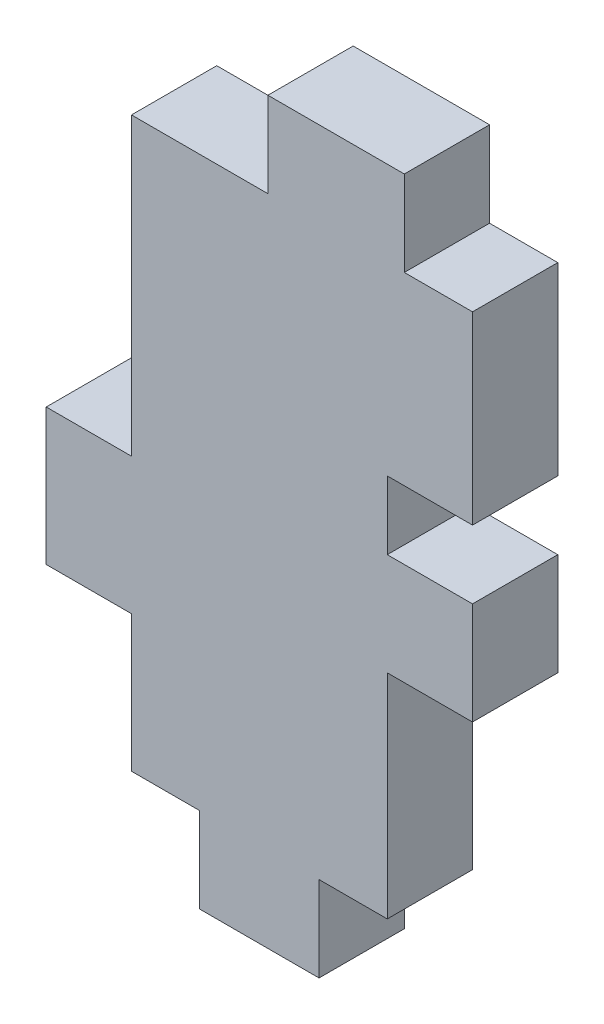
ISO-10303-21;
HEADER;
FILE_DESCRIPTION(('STEP AP214'),'2;1');
FILE_NAME('part.step','',(''),(''),'','','');
FILE_SCHEMA(('AUTOMOTIVE_DESIGN { 1 0 10303 214 1 1 1 1 }'));
ENDSEC;
DATA;
#1=APPLICATION_CONTEXT('core data for automotive mechanical design processes');
#2=APPLICATION_PROTOCOL_DEFINITION('international standard','automotive_design',2000,#1);
#3=PRODUCT_CONTEXT('',#1,'mechanical');
#4=PRODUCT('Part','Part','',(#3));
#5=PRODUCT_RELATED_PRODUCT_CATEGORY('part','',(#4));
#6=PRODUCT_DEFINITION_FORMATION('','',#4);
#7=PRODUCT_DEFINITION_CONTEXT('part definition',#1,'design');
#8=PRODUCT_DEFINITION('design','',#6,#7);
#9=PRODUCT_DEFINITION_SHAPE('','',#8);
#10=(LENGTH_UNIT() NAMED_UNIT(*) SI_UNIT(.MILLI.,.METRE.));
#11=(NAMED_UNIT(*) PLANE_ANGLE_UNIT() SI_UNIT($,.RADIAN.));
#12=(NAMED_UNIT(*) SI_UNIT($,.STERADIAN.) SOLID_ANGLE_UNIT());
#13=UNCERTAINTY_MEASURE_WITH_UNIT(LENGTH_MEASURE(1.E-05),#10,'distance_accuracy_value','');
#14=(GEOMETRIC_REPRESENTATION_CONTEXT(3) GLOBAL_UNCERTAINTY_ASSIGNED_CONTEXT((#13)) GLOBAL_UNIT_ASSIGNED_CONTEXT((#10,
#11,#12)) REPRESENTATION_CONTEXT('',''));
#15=CARTESIAN_POINT('',(0.,0.,0.));
#16=DIRECTION('',(0.,0.,1.));
#17=DIRECTION('',(1.,0.,0.));
#18=AXIS2_PLACEMENT_3D('',#15,#16,#17);
#19=CARTESIAN_POINT('',(0.,42.333333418,6.35));
#20=DIRECTION('',(0.,-1.,0.));
#21=DIRECTION('',(0.,0.,-1.));
#22=AXIS2_PLACEMENT_3D('',#19,#20,#21);
#23=PLANE('',#22);
#24=DIRECTION('',(0.,0.,1.));
#25=VECTOR('',#24,1.);
#26=CARTESIAN_POINT('',(-8.89,42.333333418,0.));
#27=LINE('',#26,#25);
#28=CARTESIAN_POINT('',(-8.89,42.333333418,0.));
#29=VERTEX_POINT('',#28);
#30=CARTESIAN_POINT('',(-8.89,42.333333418,6.35));
#31=VERTEX_POINT('',#30);
#32=EDGE_CURVE('E222',#29,#31,#27,.T.);
#33=ORIENTED_EDGE('',*,*,#32,.F.);
#34=DIRECTION('',(-1.,0.,0.));
#35=VECTOR('',#34,1.);
#36=CARTESIAN_POINT('',(0.,42.333333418,0.));
#37=LINE('',#36,#35);
#38=CARTESIAN_POINT('',(-19.05,42.333333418,0.));
#39=VERTEX_POINT('',#38);
#40=EDGE_CURVE('E387',#29,#39,#37,.T.);
#41=ORIENTED_EDGE('',*,*,#40,.T.);
#42=DIRECTION('',(0.,0.,-1.));
#43=VECTOR('',#42,1.);
#44=CARTESIAN_POINT('',(-19.05,42.333333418,6.35));
#45=LINE('',#44,#43);
#46=CARTESIAN_POINT('',(-19.05,42.333333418,6.35));
#47=VERTEX_POINT('',#46);
#48=EDGE_CURVE('E358',#47,#39,#45,.T.);
#49=ORIENTED_EDGE('',*,*,#48,.F.);
#50=DIRECTION('',(-1.,0.,0.));
#51=VECTOR('',#50,1.);
#52=CARTESIAN_POINT('',(0.,42.333333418,6.35));
#53=LINE('',#52,#51);
#54=EDGE_CURVE('E64',#31,#47,#53,.T.);
#55=ORIENTED_EDGE('',*,*,#54,.F.);
#56=EDGE_LOOP('',(#33,#41,#49,#55));
#57=FACE_BOUND('',#56,.T.);
#58=ADVANCED_FACE('F48',(#57),#23,.F.);
#59=DIRECTION('',(0.,0.,-1.));
#60=VECTOR('',#59,1.);
#61=CARTESIAN_POINT('',(1.27,42.333333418,0.));
#62=LINE('',#61,#60);
#63=CARTESIAN_POINT('',(1.27,42.333333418,6.35));
#64=VERTEX_POINT('',#63);
#65=CARTESIAN_POINT('',(1.27,42.333333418,0.));
#66=VERTEX_POINT('',#65);
#67=EDGE_CURVE('E72',#64,#66,#62,.T.);
#68=ORIENTED_EDGE('',*,*,#67,.F.);
#69=CARTESIAN_POINT('',(6.35,42.333333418,6.35));
#70=VERTEX_POINT('',#69);
#71=EDGE_CURVE('E355',#70,#64,#53,.T.);
#72=ORIENTED_EDGE('',*,*,#71,.F.);
#73=DIRECTION('',(0.,0.,1.));
#74=VECTOR('',#73,1.);
#75=CARTESIAN_POINT('',(6.35,42.333333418,6.35));
#76=LINE('',#75,#74);
#77=CARTESIAN_POINT('',(6.35,42.333333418,0.));
#78=VERTEX_POINT('',#77);
#79=EDGE_CURVE('E279',#78,#70,#76,.T.);
#80=ORIENTED_EDGE('',*,*,#79,.F.);
#81=EDGE_CURVE('E384',#78,#66,#37,.T.);
#82=ORIENTED_EDGE('',*,*,#81,.T.);
#83=EDGE_LOOP('',(#68,#72,#80,#82));
#84=FACE_BOUND('',#83,.T.);
#85=ADVANCED_FACE('F474',(#84),#23,.F.);
#86=CARTESIAN_POINT('',(-19.05,0.,6.35));
#87=DIRECTION('',(-1.,0.,0.));
#88=DIRECTION('',(0.,0.,1.));
#89=AXIS2_PLACEMENT_3D('',#86,#87,#88);
#90=PLANE('',#89);
#91=DIRECTION('',(0.,0.,-1.));
#92=VECTOR('',#91,1.);
#93=CARTESIAN_POINT('',(-19.05,20.32,0.));
#94=LINE('',#93,#92);
#95=CARTESIAN_POINT('',(-19.05,20.32,6.35));
#96=VERTEX_POINT('',#95);
#97=CARTESIAN_POINT('',(-19.05,20.32,0.));
#98=VERTEX_POINT('',#97);
#99=EDGE_CURVE('E229',#96,#98,#94,.T.);
#100=ORIENTED_EDGE('',*,*,#99,.F.);
#101=DIRECTION('',(0.,1.,0.));
#102=VECTOR('',#101,1.);
#103=CARTESIAN_POINT('',(-19.05,0.,6.35));
#104=LINE('',#103,#102);
#105=EDGE_CURVE('E336',#96,#47,#104,.T.);
#106=ORIENTED_EDGE('',*,*,#105,.T.);
#107=ORIENTED_EDGE('',*,*,#48,.T.);
#108=DIRECTION('',(0.,1.,0.));
#109=VECTOR('',#108,1.);
#110=CARTESIAN_POINT('',(-19.05,0.,0.));
#111=LINE('',#110,#109);
#112=EDGE_CURVE('E331',#98,#39,#111,.T.);
#113=ORIENTED_EDGE('',*,*,#112,.F.);
#114=EDGE_LOOP('',(#100,#106,#107,#113));
#115=FACE_BOUND('',#114,.T.);
#116=ADVANCED_FACE('F445',(#115),#90,.T.);
#117=CARTESIAN_POINT('',(0.,0.,6.35));
#118=DIRECTION('',(-1.,0.,0.));
#119=DIRECTION('',(0.,0.,1.));
#120=AXIS2_PLACEMENT_3D('',#117,#118,#119);
#121=PLANE('',#120);
#122=DIRECTION('',(0.,0.,-1.));
#123=VECTOR('',#122,1.);
#124=CARTESIAN_POINT('',(0.,28.575,6.35));
#125=LINE('',#124,#123);
#126=CARTESIAN_POINT('',(0.,28.575,6.35));
#127=VERTEX_POINT('',#126);
#128=CARTESIAN_POINT('',(0.,28.575,0.));
#129=VERTEX_POINT('',#128);
#130=EDGE_CURVE('E267',#127,#129,#125,.T.);
#131=ORIENTED_EDGE('',*,*,#130,.F.);
#132=DIRECTION('',(0.,1.,0.));
#133=VECTOR('',#132,1.);
#134=CARTESIAN_POINT('',(0.,0.,6.35));
#135=LINE('',#134,#133);
#136=CARTESIAN_POINT('',(0.,23.495,6.35));
#137=VERTEX_POINT('',#136);
#138=EDGE_CURVE('E344',#137,#127,#135,.T.);
#139=ORIENTED_EDGE('',*,*,#138,.F.);
#140=DIRECTION('',(0.,0.,-1.));
#141=VECTOR('',#140,1.);
#142=CARTESIAN_POINT('',(0.,23.495,6.35));
#143=LINE('',#142,#141);
#144=CARTESIAN_POINT('',(0.,23.495,0.));
#145=VERTEX_POINT('',#144);
#146=EDGE_CURVE('E391',#137,#145,#143,.T.);
#147=ORIENTED_EDGE('',*,*,#146,.T.);
#148=DIRECTION('',(0.,1.,0.));
#149=VECTOR('',#148,1.);
#150=CARTESIAN_POINT('',(0.,0.,0.));
#151=LINE('',#150,#149);
#152=EDGE_CURVE('E372',#145,#129,#151,.T.);
#153=ORIENTED_EDGE('',*,*,#152,.T.);
#154=EDGE_LOOP('',(#131,#139,#147,#153));
#155=FACE_BOUND('',#154,.T.);
#156=ADVANCED_FACE('F483',(#155),#121,.F.);
#157=CARTESIAN_POINT('',(0.,0.,6.35));
#158=DIRECTION('',(0.,-1.,0.));
#159=DIRECTION('',(0.,0.,-1.));
#160=AXIS2_PLACEMENT_3D('',#157,#158,#159);
#161=PLANE('',#160);
#162=DIRECTION('',(0.,0.,1.));
#163=VECTOR('',#162,1.);
#164=CARTESIAN_POINT('',(-5.08,0.,0.));
#165=LINE('',#164,#163);
#166=CARTESIAN_POINT('',(-5.08,0.,0.));
#167=VERTEX_POINT('',#166);
#168=CARTESIAN_POINT('',(-5.08,0.,6.35));
#169=VERTEX_POINT('',#168);
#170=EDGE_CURVE('E294',#167,#169,#165,.T.);
#171=ORIENTED_EDGE('',*,*,#170,.F.);
#172=DIRECTION('',(-1.,0.,0.));
#173=VECTOR('',#172,1.);
#174=CARTESIAN_POINT('',(0.,0.,0.));
#175=LINE('',#174,#173);
#176=CARTESIAN_POINT('',(0.,0.,0.));
#177=VERTEX_POINT('',#176);
#178=EDGE_CURVE('E364',#177,#167,#175,.T.);
#179=ORIENTED_EDGE('',*,*,#178,.F.);
#180=DIRECTION('',(0.,0.,-1.));
#181=VECTOR('',#180,1.);
#182=CARTESIAN_POINT('',(0.,0.,6.35));
#183=LINE('',#182,#181);
#184=CARTESIAN_POINT('',(0.,0.,6.35));
#185=VERTEX_POINT('',#184);
#186=EDGE_CURVE('E57',#185,#177,#183,.T.);
#187=ORIENTED_EDGE('',*,*,#186,.F.);
#188=DIRECTION('',(-1.,0.,0.));
#189=VECTOR('',#188,1.);
#190=CARTESIAN_POINT('',(0.,0.,6.35));
#191=LINE('',#190,#189);
#192=EDGE_CURVE('E337',#185,#169,#191,.T.);
#193=ORIENTED_EDGE('',*,*,#192,.T.);
#194=EDGE_LOOP('',(#171,#179,#187,#193));
#195=FACE_BOUND('',#194,.T.);
#196=ADVANCED_FACE('F416',(#195),#161,.T.);
#197=DIRECTION('',(0.,0.,1.));
#198=VECTOR('',#197,1.);
#199=CARTESIAN_POINT('',(-19.05,10.16,0.));
#200=LINE('',#199,#198);
#201=CARTESIAN_POINT('',(-19.05,10.16,0.));
#202=VERTEX_POINT('',#201);
#203=CARTESIAN_POINT('',(-19.05,10.16,6.35));
#204=VERTEX_POINT('',#203);
#205=EDGE_CURVE('E224',#202,#204,#200,.T.);
#206=ORIENTED_EDGE('',*,*,#205,.F.);
#207=CARTESIAN_POINT('',(-19.05,0.,0.));
#208=VERTEX_POINT('',#207);
#209=EDGE_CURVE('E359',#208,#202,#111,.T.);
#210=ORIENTED_EDGE('',*,*,#209,.F.);
#211=DIRECTION('',(0.,0.,-1.));
#212=VECTOR('',#211,1.);
#213=CARTESIAN_POINT('',(-19.05,0.,6.35));
#214=LINE('',#213,#212);
#215=CARTESIAN_POINT('',(-19.05,0.,6.35));
#216=VERTEX_POINT('',#215);
#217=EDGE_CURVE('E11',#216,#208,#214,.T.);
#218=ORIENTED_EDGE('',*,*,#217,.F.);
#219=EDGE_CURVE('E332',#216,#204,#104,.T.);
#220=ORIENTED_EDGE('',*,*,#219,.T.);
#221=EDGE_LOOP('',(#206,#210,#218,#220));
#222=FACE_BOUND('',#221,.T.);
#223=ADVANCED_FACE('F50',(#222),#90,.T.);
#224=DIRECTION('',(0.,0.,-1.));
#225=VECTOR('',#224,1.);
#226=CARTESIAN_POINT('',(-13.97,0.,0.));
#227=LINE('',#226,#225);
#228=CARTESIAN_POINT('',(-13.97,0.,6.35));
#229=VERTEX_POINT('',#228);
#230=CARTESIAN_POINT('',(-13.97,0.,0.));
#231=VERTEX_POINT('',#230);
#232=EDGE_CURVE('E300',#229,#231,#227,.T.);
#233=ORIENTED_EDGE('',*,*,#232,.F.);
#234=EDGE_CURVE('E335',#229,#216,#191,.T.);
#235=ORIENTED_EDGE('',*,*,#234,.T.);
#236=ORIENTED_EDGE('',*,*,#217,.T.);
#237=EDGE_CURVE('E363',#231,#208,#175,.T.);
#238=ORIENTED_EDGE('',*,*,#237,.F.);
#239=EDGE_LOOP('',(#233,#235,#236,#238));
#240=FACE_BOUND('',#239,.T.);
#241=ADVANCED_FACE('F431',(#240),#161,.T.);
#242=CARTESIAN_POINT('',(0.,15.875,0.));
#243=VERTEX_POINT('',#242);
#244=EDGE_CURVE('E368',#177,#243,#151,.T.);
#245=ORIENTED_EDGE('',*,*,#244,.T.);
#246=DIRECTION('',(0.,0.,-1.));
#247=VECTOR('',#246,1.);
#248=CARTESIAN_POINT('',(0.,15.875,6.35));
#249=LINE('',#248,#247);
#250=CARTESIAN_POINT('',(0.,15.875,6.35));
#251=VERTEX_POINT('',#250);
#252=EDGE_CURVE('E400',#251,#243,#249,.T.);
#253=ORIENTED_EDGE('',*,*,#252,.F.);
#254=EDGE_CURVE('E340',#185,#251,#135,.T.);
#255=ORIENTED_EDGE('',*,*,#254,.F.);
#256=ORIENTED_EDGE('',*,*,#186,.T.);
#257=EDGE_LOOP('',(#245,#253,#255,#256));
#258=FACE_BOUND('',#257,.T.);
#259=ADVANCED_FACE('F407',(#258),#121,.F.);
#260=CARTESIAN_POINT('',(0.,15.875,6.35));
#261=DIRECTION('',(0.,1.,0.));
#262=DIRECTION('',(0.,0.,1.));
#263=AXIS2_PLACEMENT_3D('',#260,#261,#262);
#264=PLANE('',#263);
#265=DIRECTION('',(1.,0.,0.));
#266=VECTOR('',#265,1.);
#267=CARTESIAN_POINT('',(0.,15.875,0.));
#268=LINE('',#267,#266);
#269=CARTESIAN_POINT('',(6.35,15.875,0.));
#270=VERTEX_POINT('',#269);
#271=EDGE_CURVE('E371',#243,#270,#268,.T.);
#272=ORIENTED_EDGE('',*,*,#271,.T.);
#273=DIRECTION('',(0.,0.,-1.));
#274=VECTOR('',#273,1.);
#275=CARTESIAN_POINT('',(6.35,15.875,6.35));
#276=LINE('',#275,#274);
#277=CARTESIAN_POINT('',(6.35,15.875,6.35));
#278=VERTEX_POINT('',#277);
#279=EDGE_CURVE('E397',#278,#270,#276,.T.);
#280=ORIENTED_EDGE('',*,*,#279,.F.);
#281=DIRECTION('',(1.,0.,0.));
#282=VECTOR('',#281,1.);
#283=CARTESIAN_POINT('',(0.,15.875,6.35));
#284=LINE('',#283,#282);
#285=EDGE_CURVE('E343',#251,#278,#284,.T.);
#286=ORIENTED_EDGE('',*,*,#285,.F.);
#287=ORIENTED_EDGE('',*,*,#252,.T.);
#288=EDGE_LOOP('',(#272,#280,#286,#287));
#289=FACE_BOUND('',#288,.T.);
#290=ADVANCED_FACE('F494',(#289),#264,.F.);
#291=CARTESIAN_POINT('',(6.35,0.,6.35));
#292=DIRECTION('',(1.,0.,0.));
#293=DIRECTION('',(0.,1.,0.));
#294=AXIS2_PLACEMENT_3D('',#291,#292,#293);
#295=PLANE('',#294);
#296=DIRECTION('',(0.,-1.,0.));
#297=VECTOR('',#296,1.);
#298=CARTESIAN_POINT('',(6.35,0.,0.));
#299=LINE('',#298,#297);
#300=CARTESIAN_POINT('',(6.35,23.495,0.));
#301=VERTEX_POINT('',#300);
#302=EDGE_CURVE('E376',#301,#270,#299,.T.);
#303=ORIENTED_EDGE('',*,*,#302,.F.);
#304=DIRECTION('',(0.,0.,-1.));
#305=VECTOR('',#304,1.);
#306=CARTESIAN_POINT('',(6.35,23.495,6.35));
#307=LINE('',#306,#305);
#308=CARTESIAN_POINT('',(6.35,23.495,6.35));
#309=VERTEX_POINT('',#308);
#310=EDGE_CURVE('E394',#309,#301,#307,.T.);
#311=ORIENTED_EDGE('',*,*,#310,.F.);
#312=DIRECTION('',(0.,-1.,0.));
#313=VECTOR('',#312,1.);
#314=CARTESIAN_POINT('',(6.35,0.,6.35));
#315=LINE('',#314,#313);
#316=EDGE_CURVE('E347',#309,#278,#315,.T.);
#317=ORIENTED_EDGE('',*,*,#316,.T.);
#318=ORIENTED_EDGE('',*,*,#279,.T.);
#319=EDGE_LOOP('',(#303,#311,#317,#318));
#320=FACE_BOUND('',#319,.T.);
#321=ADVANCED_FACE('F490',(#320),#295,.T.);
#322=CARTESIAN_POINT('',(0.,23.495,6.35));
#323=DIRECTION('',(0.,1.,0.));
#324=DIRECTION('',(0.,0.,1.));
#325=AXIS2_PLACEMENT_3D('',#322,#323,#324);
#326=PLANE('',#325);
#327=DIRECTION('',(1.,0.,0.));
#328=VECTOR('',#327,1.);
#329=CARTESIAN_POINT('',(0.,23.495,0.));
#330=LINE('',#329,#328);
#331=EDGE_CURVE('E380',#145,#301,#330,.T.);
#332=ORIENTED_EDGE('',*,*,#331,.F.);
#333=ORIENTED_EDGE('',*,*,#146,.F.);
#334=DIRECTION('',(1.,0.,0.));
#335=VECTOR('',#334,1.);
#336=CARTESIAN_POINT('',(0.,23.495,6.35));
#337=LINE('',#336,#335);
#338=EDGE_CURVE('E351',#137,#309,#337,.T.);
#339=ORIENTED_EDGE('',*,*,#338,.T.);
#340=ORIENTED_EDGE('',*,*,#310,.T.);
#341=EDGE_LOOP('',(#332,#333,#339,#340));
#342=FACE_BOUND('',#341,.T.);
#343=ADVANCED_FACE('F487',(#342),#326,.T.);
#344=CARTESIAN_POINT('',(0.,0.,6.35));
#345=DIRECTION('',(0.,0.,1.));
#346=DIRECTION('',(1.,0.,0.));
#347=AXIS2_PLACEMENT_3D('',#344,#345,#346);
#348=PLANE('',#347);
#349=ORIENTED_EDGE('',*,*,#219,.F.);
#350=ORIENTED_EDGE('',*,*,#234,.F.);
#351=DIRECTION('',(0.,1.,0.));
#352=VECTOR('',#351,1.);
#353=CARTESIAN_POINT('',(-13.97,-6.35,6.35));
#354=LINE('',#353,#352);
#355=CARTESIAN_POINT('',(-13.97,-6.35,6.35));
#356=VERTEX_POINT('',#355);
#357=EDGE_CURVE('E323',#356,#229,#354,.T.);
#358=ORIENTED_EDGE('',*,*,#357,.F.);
#359=DIRECTION('',(-1.,0.,0.));
#360=VECTOR('',#359,1.);
#361=CARTESIAN_POINT('',(-13.97,-6.35,6.35));
#362=LINE('',#361,#360);
#363=CARTESIAN_POINT('',(-5.08,-6.35,6.35));
#364=VERTEX_POINT('',#363);
#365=EDGE_CURVE('E299',#364,#356,#362,.T.);
#366=ORIENTED_EDGE('',*,*,#365,.F.);
#367=DIRECTION('',(0.,1.,0.));
#368=VECTOR('',#367,1.);
#369=CARTESIAN_POINT('',(-5.08,-6.35,6.35));
#370=LINE('',#369,#368);
#371=EDGE_CURVE('E327',#364,#169,#370,.T.);
#372=ORIENTED_EDGE('',*,*,#371,.T.);
#373=ORIENTED_EDGE('',*,*,#192,.F.);
#374=ORIENTED_EDGE('',*,*,#254,.T.);
#375=ORIENTED_EDGE('',*,*,#285,.T.);
#376=ORIENTED_EDGE('',*,*,#316,.F.);
#377=ORIENTED_EDGE('',*,*,#338,.F.);
#378=ORIENTED_EDGE('',*,*,#138,.T.);
#379=DIRECTION('',(-1.,0.,0.));
#380=VECTOR('',#379,1.);
#381=CARTESIAN_POINT('',(6.35,28.575,6.35));
#382=LINE('',#381,#380);
#383=CARTESIAN_POINT('',(6.35,28.575,6.35));
#384=VERTEX_POINT('',#383);
#385=EDGE_CURVE('E290',#384,#127,#382,.T.);
#386=ORIENTED_EDGE('',*,*,#385,.F.);
#387=DIRECTION('',(0.,-1.,0.));
#388=VECTOR('',#387,1.);
#389=CARTESIAN_POINT('',(6.35,42.333333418,6.35));
#390=LINE('',#389,#388);
#391=EDGE_CURVE('E268',#70,#384,#390,.T.);
#392=ORIENTED_EDGE('',*,*,#391,.F.);
#393=ORIENTED_EDGE('',*,*,#71,.T.);
#394=DIRECTION('',(0.,-1.,0.));
#395=VECTOR('',#394,1.);
#396=CARTESIAN_POINT('',(1.27,48.683333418,6.35));
#397=LINE('',#396,#395);
#398=CARTESIAN_POINT('',(1.27,48.683333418,6.35));
#399=VERTEX_POINT('',#398);
#400=EDGE_CURVE('E205',#399,#64,#397,.T.);
#401=ORIENTED_EDGE('',*,*,#400,.F.);
#402=DIRECTION('',(1.,0.,0.));
#403=VECTOR('',#402,1.);
#404=CARTESIAN_POINT('',(-8.89,48.683333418,6.35));
#405=LINE('',#404,#403);
#406=CARTESIAN_POINT('',(-8.89,48.683333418,6.35));
#407=VERTEX_POINT('',#406);
#408=EDGE_CURVE('E197',#407,#399,#405,.T.);
#409=ORIENTED_EDGE('',*,*,#408,.F.);
#410=DIRECTION('',(0.,-1.,0.));
#411=VECTOR('',#410,1.);
#412=CARTESIAN_POINT('',(-8.89,48.683333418,6.35));
#413=LINE('',#412,#411);
#414=EDGE_CURVE('E202',#407,#31,#413,.T.);
#415=ORIENTED_EDGE('',*,*,#414,.T.);
#416=ORIENTED_EDGE('',*,*,#54,.T.);
#417=ORIENTED_EDGE('',*,*,#105,.F.);
#418=DIRECTION('',(1.,0.,0.));
#419=VECTOR('',#418,1.);
#420=CARTESIAN_POINT('',(-25.4,20.32,6.35));
#421=LINE('',#420,#419);
#422=CARTESIAN_POINT('',(-25.4,20.32,6.35));
#423=VERTEX_POINT('',#422);
#424=EDGE_CURVE('E255',#423,#96,#421,.T.);
#425=ORIENTED_EDGE('',*,*,#424,.F.);
#426=DIRECTION('',(0.,1.,0.));
#427=VECTOR('',#426,1.);
#428=CARTESIAN_POINT('',(-25.4,20.32,6.35));
#429=LINE('',#428,#427);
#430=CARTESIAN_POINT('',(-25.4,10.16,6.35));
#431=VERTEX_POINT('',#430);
#432=EDGE_CURVE('E242',#431,#423,#429,.T.);
#433=ORIENTED_EDGE('',*,*,#432,.F.);
#434=DIRECTION('',(1.,0.,0.));
#435=VECTOR('',#434,1.);
#436=CARTESIAN_POINT('',(-25.4,10.16,6.35));
#437=LINE('',#436,#435);
#438=EDGE_CURVE('E259',#431,#204,#437,.T.);
#439=ORIENTED_EDGE('',*,*,#438,.T.);
#440=EDGE_LOOP('',(#349,#350,#358,#366,#372,#373,#374,#375,#376,#377,#378,#386,#392,#393,#401,
#409,#415,#416,#417,#425,#433,#439));
#441=FACE_BOUND('',#440,.T.);
#442=ADVANCED_FACE('F200',(#441),#348,.T.);
#443=CARTESIAN_POINT('',(0.,0.,0.));
#444=DIRECTION('',(0.,0.,1.));
#445=DIRECTION('',(1.,0.,0.));
#446=AXIS2_PLACEMENT_3D('',#443,#444,#445);
#447=PLANE('',#446);
#448=ORIENTED_EDGE('',*,*,#209,.T.);
#449=DIRECTION('',(1.,0.,0.));
#450=VECTOR('',#449,1.);
#451=CARTESIAN_POINT('',(-25.4,10.16,0.));
#452=LINE('',#451,#450);
#453=CARTESIAN_POINT('',(-25.4,10.16,0.));
#454=VERTEX_POINT('',#453);
#455=EDGE_CURVE('E263',#454,#202,#452,.T.);
#456=ORIENTED_EDGE('',*,*,#455,.F.);
#457=DIRECTION('',(0.,-1.,0.));
#458=VECTOR('',#457,1.);
#459=CARTESIAN_POINT('',(-25.4,20.32,0.));
#460=LINE('',#459,#458);
#461=CARTESIAN_POINT('',(-25.4,20.32,0.));
#462=VERTEX_POINT('',#461);
#463=EDGE_CURVE('E235',#462,#454,#460,.T.);
#464=ORIENTED_EDGE('',*,*,#463,.F.);
#465=DIRECTION('',(1.,0.,0.));
#466=VECTOR('',#465,1.);
#467=CARTESIAN_POINT('',(-25.4,20.32,0.));
#468=LINE('',#467,#466);
#469=EDGE_CURVE('E247',#462,#98,#468,.T.);
#470=ORIENTED_EDGE('',*,*,#469,.T.);
#471=ORIENTED_EDGE('',*,*,#112,.T.);
#472=ORIENTED_EDGE('',*,*,#40,.F.);
#473=DIRECTION('',(0.,-1.,0.));
#474=VECTOR('',#473,1.);
#475=CARTESIAN_POINT('',(-8.89,48.683333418,0.));
#476=LINE('',#475,#474);
#477=CARTESIAN_POINT('',(-8.89,48.683333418,0.));
#478=VERTEX_POINT('',#477);
#479=EDGE_CURVE('E454',#478,#29,#476,.T.);
#480=ORIENTED_EDGE('',*,*,#479,.F.);
#481=DIRECTION('',(-1.,0.,0.));
#482=VECTOR('',#481,1.);
#483=CARTESIAN_POINT('',(-8.89,48.683333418,0.));
#484=LINE('',#483,#482);
#485=CARTESIAN_POINT('',(1.27,48.683333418,0.));
#486=VERTEX_POINT('',#485);
#487=EDGE_CURVE('E215',#486,#478,#484,.T.);
#488=ORIENTED_EDGE('',*,*,#487,.F.);
#489=DIRECTION('',(0.,-1.,0.));
#490=VECTOR('',#489,1.);
#491=CARTESIAN_POINT('',(1.27,48.683333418,0.));
#492=LINE('',#491,#490);
#493=EDGE_CURVE('E231',#486,#66,#492,.T.);
#494=ORIENTED_EDGE('',*,*,#493,.T.);
#495=ORIENTED_EDGE('',*,*,#81,.F.);
#496=DIRECTION('',(0.,1.,0.));
#497=VECTOR('',#496,1.);
#498=CARTESIAN_POINT('',(6.35,42.333333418,0.));
#499=LINE('',#498,#497);
#500=CARTESIAN_POINT('',(6.35,28.575,0.));
#501=VERTEX_POINT('',#500);
#502=EDGE_CURVE('E275',#501,#78,#499,.T.);
#503=ORIENTED_EDGE('',*,*,#502,.F.);
#504=DIRECTION('',(-1.,0.,0.));
#505=VECTOR('',#504,1.);
#506=CARTESIAN_POINT('',(6.35,28.575,0.));
#507=LINE('',#506,#505);
#508=EDGE_CURVE('E283',#501,#129,#507,.T.);
#509=ORIENTED_EDGE('',*,*,#508,.T.);
#510=ORIENTED_EDGE('',*,*,#152,.F.);
#511=ORIENTED_EDGE('',*,*,#331,.T.);
#512=ORIENTED_EDGE('',*,*,#302,.T.);
#513=ORIENTED_EDGE('',*,*,#271,.F.);
#514=ORIENTED_EDGE('',*,*,#244,.F.);
#515=ORIENTED_EDGE('',*,*,#178,.T.);
#516=DIRECTION('',(0.,1.,0.));
#517=VECTOR('',#516,1.);
#518=CARTESIAN_POINT('',(-5.08,-6.35,0.));
#519=LINE('',#518,#517);
#520=CARTESIAN_POINT('',(-5.08,-6.35,0.));
#521=VERTEX_POINT('',#520);
#522=EDGE_CURVE('E309',#521,#167,#519,.T.);
#523=ORIENTED_EDGE('',*,*,#522,.F.);
#524=DIRECTION('',(1.,0.,0.));
#525=VECTOR('',#524,1.);
#526=CARTESIAN_POINT('',(-13.97,-6.35,0.));
#527=LINE('',#526,#525);
#528=CARTESIAN_POINT('',(-13.97,-6.35,0.));
#529=VERTEX_POINT('',#528);
#530=EDGE_CURVE('E306',#529,#521,#527,.T.);
#531=ORIENTED_EDGE('',*,*,#530,.F.);
#532=DIRECTION('',(0.,1.,0.));
#533=VECTOR('',#532,1.);
#534=CARTESIAN_POINT('',(-13.97,-6.35,0.));
#535=LINE('',#534,#533);
#536=EDGE_CURVE('E319',#529,#231,#535,.T.);
#537=ORIENTED_EDGE('',*,*,#536,.T.);
#538=ORIENTED_EDGE('',*,*,#237,.T.);
#539=EDGE_LOOP('',(#448,#456,#464,#470,#471,#472,#480,#488,#494,#495,#503,#509,#510,#511,#512,
#513,#514,#515,#523,#531,#537,#538));
#540=FACE_BOUND('',#539,.T.);
#541=ADVANCED_FACE('F414',(#540),#447,.F.);
#542=CARTESIAN_POINT('',(-5.08,-6.35,0.));
#543=DIRECTION('',(-1.,0.,0.));
#544=DIRECTION('',(0.,0.,1.));
#545=AXIS2_PLACEMENT_3D('',#542,#543,#544);
#546=PLANE('',#545);
#547=ORIENTED_EDGE('',*,*,#170,.T.);
#548=ORIENTED_EDGE('',*,*,#371,.F.);
#549=DIRECTION('',(0.,0.,1.));
#550=VECTOR('',#549,1.);
#551=CARTESIAN_POINT('',(-5.08,-6.35,0.));
#552=LINE('',#551,#550);
#553=EDGE_CURVE('E295',#521,#364,#552,.T.);
#554=ORIENTED_EDGE('',*,*,#553,.F.);
#555=ORIENTED_EDGE('',*,*,#522,.T.);
#556=EDGE_LOOP('',(#547,#548,#554,#555));
#557=FACE_BOUND('',#556,.T.);
#558=ADVANCED_FACE('F419',(#557),#546,.F.);
#559=CARTESIAN_POINT('',(-13.97,-6.35,0.));
#560=DIRECTION('',(1.,0.,0.));
#561=DIRECTION('',(0.,0.,-1.));
#562=AXIS2_PLACEMENT_3D('',#559,#560,#561);
#563=PLANE('',#562);
#564=ORIENTED_EDGE('',*,*,#232,.T.);
#565=ORIENTED_EDGE('',*,*,#536,.F.);
#566=DIRECTION('',(0.,0.,-1.));
#567=VECTOR('',#566,1.);
#568=CARTESIAN_POINT('',(-13.97,-6.35,0.));
#569=LINE('',#568,#567);
#570=EDGE_CURVE('E303',#356,#529,#569,.T.);
#571=ORIENTED_EDGE('',*,*,#570,.F.);
#572=ORIENTED_EDGE('',*,*,#357,.T.);
#573=EDGE_LOOP('',(#564,#565,#571,#572));
#574=FACE_BOUND('',#573,.T.);
#575=ADVANCED_FACE('F428',(#574),#563,.F.);
#576=CARTESIAN_POINT('',(0.,-6.35,0.));
#577=DIRECTION('',(0.,1.,0.));
#578=DIRECTION('',(0.,0.,1.));
#579=AXIS2_PLACEMENT_3D('',#576,#577,#578);
#580=PLANE('',#579);
#581=ORIENTED_EDGE('',*,*,#553,.T.);
#582=ORIENTED_EDGE('',*,*,#365,.T.);
#583=ORIENTED_EDGE('',*,*,#570,.T.);
#584=ORIENTED_EDGE('',*,*,#530,.T.);
#585=EDGE_LOOP('',(#581,#582,#583,#584));
#586=FACE_BOUND('',#585,.T.);
#587=ADVANCED_FACE('F424',(#586),#580,.F.);
#588=CARTESIAN_POINT('',(6.35,28.575,6.35));
#589=DIRECTION('',(0.,1.,0.));
#590=DIRECTION('',(0.,0.,1.));
#591=AXIS2_PLACEMENT_3D('',#588,#589,#590);
#592=PLANE('',#591);
#593=ORIENTED_EDGE('',*,*,#130,.T.);
#594=ORIENTED_EDGE('',*,*,#508,.F.);
#595=DIRECTION('',(0.,0.,-1.));
#596=VECTOR('',#595,1.);
#597=CARTESIAN_POINT('',(6.35,28.575,6.35));
#598=LINE('',#597,#596);
#599=EDGE_CURVE('E272',#384,#501,#598,.T.);
#600=ORIENTED_EDGE('',*,*,#599,.F.);
#601=ORIENTED_EDGE('',*,*,#385,.T.);
#602=EDGE_LOOP('',(#593,#594,#600,#601));
#603=FACE_BOUND('',#602,.T.);
#604=ADVANCED_FACE('F640',(#603),#592,.F.);
#605=CARTESIAN_POINT('',(6.35,0.,0.));
#606=DIRECTION('',(1.,0.,0.));
#607=DIRECTION('',(0.,0.,-1.));
#608=AXIS2_PLACEMENT_3D('',#605,#606,#607);
#609=PLANE('',#608);
#610=ORIENTED_EDGE('',*,*,#391,.T.);
#611=ORIENTED_EDGE('',*,*,#599,.T.);
#612=ORIENTED_EDGE('',*,*,#502,.T.);
#613=ORIENTED_EDGE('',*,*,#79,.T.);
#614=EDGE_LOOP('',(#610,#611,#612,#613));
#615=FACE_BOUND('',#614,.T.);
#616=ADVANCED_FACE('F557',(#615),#609,.T.);
#617=CARTESIAN_POINT('',(-25.4,10.16,0.));
#618=DIRECTION('',(0.,1.,0.));
#619=DIRECTION('',(0.,0.,1.));
#620=AXIS2_PLACEMENT_3D('',#617,#618,#619);
#621=PLANE('',#620);
#622=ORIENTED_EDGE('',*,*,#205,.T.);
#623=ORIENTED_EDGE('',*,*,#438,.F.);
#624=DIRECTION('',(0.,0.,1.));
#625=VECTOR('',#624,1.);
#626=CARTESIAN_POINT('',(-25.4,10.16,0.));
#627=LINE('',#626,#625);
#628=EDGE_CURVE('E239',#454,#431,#627,.T.);
#629=ORIENTED_EDGE('',*,*,#628,.F.);
#630=ORIENTED_EDGE('',*,*,#455,.T.);
#631=EDGE_LOOP('',(#622,#623,#629,#630));
#632=FACE_BOUND('',#631,.T.);
#633=ADVANCED_FACE('F552',(#632),#621,.F.);
#634=CARTESIAN_POINT('',(-25.4,20.32,0.));
#635=DIRECTION('',(0.,-1.,0.));
#636=DIRECTION('',(0.,0.,-1.));
#637=AXIS2_PLACEMENT_3D('',#634,#635,#636);
#638=PLANE('',#637);
#639=ORIENTED_EDGE('',*,*,#99,.T.);
#640=ORIENTED_EDGE('',*,*,#469,.F.);
#641=DIRECTION('',(0.,0.,-1.));
#642=VECTOR('',#641,1.);
#643=CARTESIAN_POINT('',(-25.4,20.32,0.));
#644=LINE('',#643,#642);
#645=EDGE_CURVE('E245',#423,#462,#644,.T.);
#646=ORIENTED_EDGE('',*,*,#645,.F.);
#647=ORIENTED_EDGE('',*,*,#424,.T.);
#648=EDGE_LOOP('',(#639,#640,#646,#647));
#649=FACE_BOUND('',#648,.T.);
#650=ADVANCED_FACE('F556',(#649),#638,.F.);
#651=CARTESIAN_POINT('',(-25.4,0.,0.));
#652=DIRECTION('',(-1.,0.,0.));
#653=DIRECTION('',(0.,0.,1.));
#654=AXIS2_PLACEMENT_3D('',#651,#652,#653);
#655=PLANE('',#654);
#656=ORIENTED_EDGE('',*,*,#463,.T.);
#657=ORIENTED_EDGE('',*,*,#628,.T.);
#658=ORIENTED_EDGE('',*,*,#432,.T.);
#659=ORIENTED_EDGE('',*,*,#645,.T.);
#660=EDGE_LOOP('',(#656,#657,#658,#659));
#661=FACE_BOUND('',#660,.T.);
#662=ADVANCED_FACE('F471',(#661),#655,.T.);
#663=CARTESIAN_POINT('',(-8.89,48.683333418,0.));
#664=DIRECTION('',(1.,0.,0.));
#665=DIRECTION('',(0.,0.,-1.));
#666=AXIS2_PLACEMENT_3D('',#663,#664,#665);
#667=PLANE('',#666);
#668=ORIENTED_EDGE('',*,*,#32,.T.);
#669=ORIENTED_EDGE('',*,*,#414,.F.);
#670=DIRECTION('',(0.,0.,1.));
#671=VECTOR('',#670,1.);
#672=CARTESIAN_POINT('',(-8.89,48.683333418,0.));
#673=LINE('',#672,#671);
#674=EDGE_CURVE('E210',#478,#407,#673,.T.);
#675=ORIENTED_EDGE('',*,*,#674,.F.);
#676=ORIENTED_EDGE('',*,*,#479,.T.);
#677=EDGE_LOOP('',(#668,#669,#675,#676));
#678=FACE_BOUND('',#677,.T.);
#679=ADVANCED_FACE('F221',(#678),#667,.F.);
#680=CARTESIAN_POINT('',(1.27,48.683333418,0.));
#681=DIRECTION('',(-1.,0.,0.));
#682=DIRECTION('',(0.,0.,1.));
#683=AXIS2_PLACEMENT_3D('',#680,#681,#682);
#684=PLANE('',#683);
#685=ORIENTED_EDGE('',*,*,#67,.T.);
#686=ORIENTED_EDGE('',*,*,#493,.F.);
#687=DIRECTION('',(0.,0.,-1.));
#688=VECTOR('',#687,1.);
#689=CARTESIAN_POINT('',(1.27,48.683333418,0.));
#690=LINE('',#689,#688);
#691=EDGE_CURVE('E209',#399,#486,#690,.T.);
#692=ORIENTED_EDGE('',*,*,#691,.F.);
#693=ORIENTED_EDGE('',*,*,#400,.T.);
#694=EDGE_LOOP('',(#685,#686,#692,#693));
#695=FACE_BOUND('',#694,.T.);
#696=ADVANCED_FACE('F461',(#695),#684,.F.);
#697=CARTESIAN_POINT('',(0.,48.683333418,0.));
#698=DIRECTION('',(0.,1.,0.));
#699=DIRECTION('',(0.,0.,1.));
#700=AXIS2_PLACEMENT_3D('',#697,#698,#699);
#701=PLANE('',#700);
#702=ORIENTED_EDGE('',*,*,#674,.T.);
#703=ORIENTED_EDGE('',*,*,#408,.T.);
#704=ORIENTED_EDGE('',*,*,#691,.T.);
#705=ORIENTED_EDGE('',*,*,#487,.T.);
#706=EDGE_LOOP('',(#702,#703,#704,#705));
#707=FACE_BOUND('',#706,.T.);
#708=ADVANCED_FACE('F213',(#707),#701,.T.);
#709=CLOSED_SHELL('',(#58,#85,#116,#156,#196,#223,#241,#259,#290,#321,#343,#442,#541,#558,#575,
#587,#604,#616,#633,#650,#662,#679,#696,#708));
#710=MANIFOLD_SOLID_BREP('B2',#709);
#711=ADVANCED_BREP_SHAPE_REPRESENTATION('',(#18,#710),#14);
#712=SHAPE_DEFINITION_REPRESENTATION(#9,#711);
ENDSEC;
END-ISO-10303-21;
